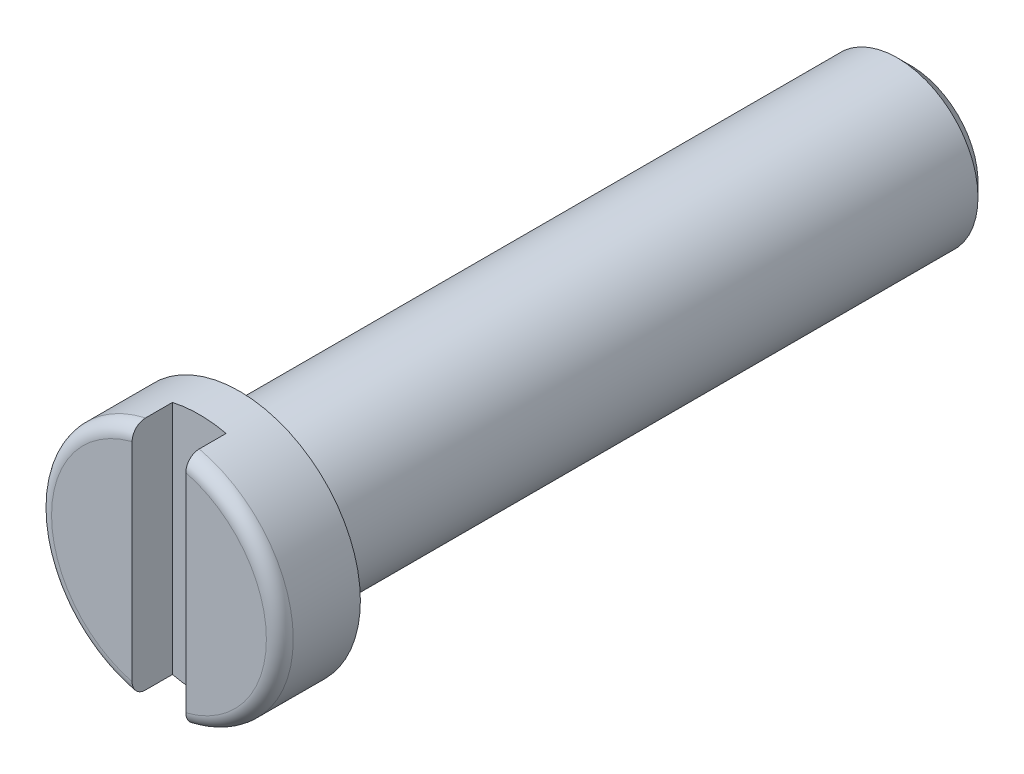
ISO-10303-21;
HEADER;
FILE_DESCRIPTION(('STEP AP214'),'2;1');
FILE_NAME('part.step','',(''),(''),'','','');
FILE_SCHEMA(('AUTOMOTIVE_DESIGN { 1 0 10303 214 1 1 1 1 }'));
ENDSEC;
DATA;
#1=APPLICATION_CONTEXT('core data for automotive mechanical design processes');
#2=APPLICATION_PROTOCOL_DEFINITION('international standard','automotive_design',2000,#1);
#3=PRODUCT_CONTEXT('',#1,'mechanical');
#4=PRODUCT('Part','Part','',(#3));
#5=PRODUCT_RELATED_PRODUCT_CATEGORY('part','',(#4));
#6=PRODUCT_DEFINITION_FORMATION('','',#4);
#7=PRODUCT_DEFINITION_CONTEXT('part definition',#1,'design');
#8=PRODUCT_DEFINITION('design','',#6,#7);
#9=PRODUCT_DEFINITION_SHAPE('','',#8);
#10=(LENGTH_UNIT() NAMED_UNIT(*) SI_UNIT(.MILLI.,.METRE.));
#11=(NAMED_UNIT(*) PLANE_ANGLE_UNIT() SI_UNIT($,.RADIAN.));
#12=(NAMED_UNIT(*) SI_UNIT($,.STERADIAN.) SOLID_ANGLE_UNIT());
#13=UNCERTAINTY_MEASURE_WITH_UNIT(LENGTH_MEASURE(1.E-05),#10,'distance_accuracy_value','');
#14=(GEOMETRIC_REPRESENTATION_CONTEXT(3) GLOBAL_UNCERTAINTY_ASSIGNED_CONTEXT((#13)) GLOBAL_UNIT_ASSIGNED_CONTEXT((#10,
#11,#12)) REPRESENTATION_CONTEXT('',''));
#15=CARTESIAN_POINT('',(0.,0.,0.));
#16=DIRECTION('',(0.,0.,1.));
#17=DIRECTION('',(1.,0.,0.));
#18=AXIS2_PLACEMENT_3D('',#15,#16,#17);
#19=CARTESIAN_POINT('',(0.,0.,3.));
#20=DIRECTION('',(0.,0.,1.));
#21=DIRECTION('',(1.,0.,0.));
#22=AXIS2_PLACEMENT_3D('',#19,#20,#21);
#23=PLANE('',#22);
#24=DIRECTION('',(0.,-1.,0.));
#25=VECTOR('',#24,1.);
#26=CARTESIAN_POINT('',(-1.,4.8446694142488,3.));
#27=LINE('',#26,#25);
#28=CARTESIAN_POINT('',(-1.,3.87298334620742,3.));
#29=VERTEX_POINT('',#28);
#30=CARTESIAN_POINT('',(-1.,-3.87298334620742,3.));
#31=VERTEX_POINT('',#30);
#32=EDGE_CURVE('E90',#29,#31,#27,.T.);
#33=ORIENTED_EDGE('',*,*,#32,.F.);
#34=CARTESIAN_POINT('',(0.,0.,3.));
#35=DIRECTION('',(0.,0.,1.));
#36=DIRECTION('',(1.,0.,0.));
#37=AXIS2_PLACEMENT_3D('',#34,#35,#36);
#38=CIRCLE('',#37,4.);
#39=EDGE_CURVE('E101',#29,#31,#38,.T.);
#40=ORIENTED_EDGE('',*,*,#39,.T.);
#41=EDGE_LOOP('',(#33,#40));
#42=FACE_BOUND('',#41,.T.);
#43=ADVANCED_FACE('F35',(#42),#23,.T.);
#44=CARTESIAN_POINT('',(0.,0.,2.5));
#45=DIRECTION('',(0.,0.,1.));
#46=DIRECTION('',(1.,0.,0.));
#47=AXIS2_PLACEMENT_3D('',#44,#45,#46);
#48=TOROIDAL_SURFACE('',#47,4.,0.5);
#49=CARTESIAN_POINT('',(-0.999999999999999,-4.32830289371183,2.73313755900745));
#50=CARTESIAN_POINT('',(-0.999999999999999,-4.34139692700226,2.70893011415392));
#51=CARTESIAN_POINT('',(-0.999999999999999,-4.35247607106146,2.68361258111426));
#52=CARTESIAN_POINT('',(-0.999999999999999,-4.37024206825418,2.63145979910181));
#53=CARTESIAN_POINT('',(-0.999999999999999,-4.3769246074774,2.60462308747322));
#54=CARTESIAN_POINT('',(-0.999999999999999,-4.38567140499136,2.55020578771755));
#55=CARTESIAN_POINT('',(-0.999999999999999,-4.38773592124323,2.52262524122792));
#56=CARTESIAN_POINT('',(-0.999999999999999,-4.38717864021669,2.46751789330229));
#57=CARTESIAN_POINT('',(-0.999999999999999,-4.38455784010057,2.43999108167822));
#58=CARTESIAN_POINT('',(-0.999999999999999,-4.37474078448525,2.3859011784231));
#59=CARTESIAN_POINT('',(-0.999999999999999,-4.3675661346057,2.35933415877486));
#60=CARTESIAN_POINT('',(-0.999999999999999,-4.34888894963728,2.30776860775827));
#61=CARTESIAN_POINT('',(-0.999999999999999,-4.33738623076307,2.282770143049));
#62=CARTESIAN_POINT('',(-0.999999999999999,-4.31031223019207,2.23484839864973));
#63=CARTESIAN_POINT('',(-0.999999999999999,-4.29471242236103,2.21194124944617));
#64=CARTESIAN_POINT('',(-0.999999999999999,-4.25995757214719,2.16900704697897));
#65=CARTESIAN_POINT('',(-1.,-4.2408022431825,2.14898022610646));
#66=CARTESIAN_POINT('',(-1.,-4.19908637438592,2.11194360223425));
#67=CARTESIAN_POINT('',(-1.,-4.17646615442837,2.09500105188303));
#68=CARTESIAN_POINT('',(-1.,-4.12876331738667,2.06503880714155));
#69=CARTESIAN_POINT('',(-1.,-4.10368039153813,2.05201960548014));
#70=CARTESIAN_POINT('',(-1.,-4.0510522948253,2.02990560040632));
#71=CARTESIAN_POINT('',(-1.,-4.0234593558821,2.02092447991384));
#72=CARTESIAN_POINT('',(-1.,-3.96717619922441,2.00759679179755));
#73=CARTESIAN_POINT('',(-1.,-3.93848582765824,2.00325087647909));
#74=CARTESIAN_POINT('',(-1.,-3.88006131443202,1.9992227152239));
#75=CARTESIAN_POINT('',(-1.,-3.85031895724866,1.99965911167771));
#76=CARTESIAN_POINT('',(-1.,-3.79131568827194,2.00545202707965));
#77=CARTESIAN_POINT('',(-1.,-3.76205482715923,2.01080906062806));
#78=CARTESIAN_POINT('',(-1.,-3.70446791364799,2.02640202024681));
#79=CARTESIAN_POINT('',(-1.,-3.67615807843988,2.03669798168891));
#80=CARTESIAN_POINT('',(-1.,-3.6216883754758,2.06193749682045));
#81=CARTESIAN_POINT('',(-1.,-3.59552850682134,2.07688104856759));
#82=CARTESIAN_POINT('',(-1.,-3.54638519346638,2.11088668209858));
#83=CARTESIAN_POINT('',(-1.,-3.52337509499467,2.12991018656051));
#84=CARTESIAN_POINT('',(-1.,-3.48100222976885,2.17166261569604));
#85=CARTESIAN_POINT('',(-1.,-3.46163884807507,2.19439091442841));
#86=CARTESIAN_POINT('',(-1.,-3.42777949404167,2.24216206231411));
#87=CARTESIAN_POINT('',(-1.,-3.41315046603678,2.26711053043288));
#88=CARTESIAN_POINT('',(-1.,-3.38848721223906,2.31918403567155));
#89=CARTESIAN_POINT('',(-1.,-3.37845177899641,2.34630849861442));
#90=CARTESIAN_POINT('',(-1.,-3.36365879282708,2.40081837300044));
#91=CARTESIAN_POINT('',(-1.,-3.35870984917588,2.42815191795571));
#92=CARTESIAN_POINT('',(-1.,-3.3535965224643,2.4832614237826));
#93=CARTESIAN_POINT('',(-1.,-3.35343132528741,2.51103730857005));
#94=CARTESIAN_POINT('',(-1.,-3.3578362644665,2.56553821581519));
#95=CARTESIAN_POINT('',(-1.,-3.36229324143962,2.59227248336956));
#96=CARTESIAN_POINT('',(-1.,-3.37560749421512,2.64461951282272));
#97=CARTESIAN_POINT('',(-1.,-3.38446478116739,2.67023227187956));
#98=CARTESIAN_POINT('',(-1.,-3.4063391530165,2.71979373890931));
#99=CARTESIAN_POINT('',(-1.,-3.419380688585,2.74373163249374));
#100=CARTESIAN_POINT('',(-1.,-3.44918161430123,2.78916638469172));
#101=CARTESIAN_POINT('',(-1.,-3.46594149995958,2.81066291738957));
#102=CARTESIAN_POINT('',(-1.,-3.50324655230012,2.85132881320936));
#103=CARTESIAN_POINT('',(-1.,-3.52389325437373,2.87040497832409));
#104=CARTESIAN_POINT('',(-1.,-3.56799383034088,2.90497477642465));
#105=CARTESIAN_POINT('',(-1.,-3.59144823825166,2.92046772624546));
#106=CARTESIAN_POINT('',(-1.,-3.64145927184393,2.94804315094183));
#107=CARTESIAN_POINT('',(-1.,-3.66810009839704,2.95997301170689));
#108=CARTESIAN_POINT('',(-1.,-3.72297295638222,2.97932213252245));
#109=CARTESIAN_POINT('',(-1.,-3.75120523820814,2.98674068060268));
#110=CARTESIAN_POINT('',(-1.,-3.80925458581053,2.99702144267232));
#111=CARTESIAN_POINT('',(-1.,-3.83909379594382,2.99975905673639));
#112=CARTESIAN_POINT('',(-1.,-3.89881097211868,3.00021047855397));
#113=CARTESIAN_POINT('',(-1.,-3.92868893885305,2.99792419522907));
#114=CARTESIAN_POINT('',(-1.,-3.9877578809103,2.98833959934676));
#115=CARTESIAN_POINT('',(-1.,-4.01694556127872,2.98102090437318));
#116=CARTESIAN_POINT('',(-1.,-4.0736528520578,2.96150482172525));
#117=CARTESIAN_POINT('',(-1.,-4.10117215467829,2.94930653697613));
#118=CARTESIAN_POINT('',(-1.,-4.15327407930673,2.92056157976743));
#119=CARTESIAN_POINT('',(-1.,-4.17789596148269,2.90408604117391));
#120=CARTESIAN_POINT('',(-1.,-4.22390116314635,2.86713988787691));
#121=CARTESIAN_POINT('',(-1.,-4.24528888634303,2.84667479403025));
#122=CARTESIAN_POINT('',(-1.,-4.27696773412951,2.81052652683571));
#123=CARTESIAN_POINT('',(-0.999999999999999,-4.28844231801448,2.79586319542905));
#124=CARTESIAN_POINT('',(-0.999999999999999,-4.30968558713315,2.76534805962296));
#125=CARTESIAN_POINT('',(-0.999999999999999,-4.31945430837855,2.74949628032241));
#126=CARTESIAN_POINT('',(-0.999999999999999,-4.32830289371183,2.73313755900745));
#127=B_SPLINE_CURVE_WITH_KNOTS('',3,(#49,#50,#51,#52,#53,#54,#55,#56,#57,#58,#59,#60,#61,#62,
#63,#64,#65,#66,#67,#68,#69,#70,#71,#72,#73,#74,#75,#76,#77,#78,#79,#80,#81,#82,#83,#84,#85,#86,
#87,#88,#89,#90,#91,#92,#93,#94,#95,#96,#97,#98,#99,#100,#101,#102,#103,#104,#105,#106,#107,
#108,#109,#110,#111,#112,#113,#114,#115,#116,#117,#118,#119,#120,#121,#122,#123,#124,#125,#126),
.UNSPECIFIED.,.T.,.F.,(4,2,2,2,2,2,2,2,2,2,2,2,2,2,2,2,2,2,2,2,2,2,2,2,2,2,2,2,2,2,2,2,2,2,2,2,
2,2,4),(0.,0.0824988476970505,0.165078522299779,0.247653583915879,0.330211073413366,
0.41237976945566,0.494551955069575,0.577312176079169,0.660079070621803,0.744477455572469,
0.828886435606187,0.915542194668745,1.00221014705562,1.09103297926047,1.17986510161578,
1.26980549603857,1.35974585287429,1.44887059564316,1.53798029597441,1.62430876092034,
1.71061452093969,1.79353865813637,1.87644868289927,1.95737576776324,2.03830305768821,
2.11971213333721,2.20113206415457,2.28508485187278,2.36905363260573,2.45622501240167,
2.54341014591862,2.63288184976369,2.72235517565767,2.81219304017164,2.90204742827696,
2.99049381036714,3.07881865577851,3.13457027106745,3.1903207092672),.UNSPECIFIED.);
#128=CARTESIAN_POINT('',(-0.999999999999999,-4.38748219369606,2.5));
#129=VERTEX_POINT('',#128);
#130=EDGE_CURVE('E59',#31,#129,#127,.T.);
#131=ORIENTED_EDGE('',*,*,#130,.F.);
#132=ORIENTED_EDGE('',*,*,#39,.F.);
#133=CARTESIAN_POINT('',(-1.,3.39057443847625,2.6836974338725));
#134=CARTESIAN_POINT('',(-1.,3.38026979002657,2.65867363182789));
#135=CARTESIAN_POINT('',(-1.,3.37204228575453,2.63277673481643));
#136=CARTESIAN_POINT('',(-1.,3.36004261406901,2.57995244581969));
#137=CARTESIAN_POINT('',(-1.,3.35627419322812,2.55302420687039));
#138=CARTESIAN_POINT('',(-1.,3.35333822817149,2.49891568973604));
#139=CARTESIAN_POINT('',(-1.,3.35417065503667,2.47173541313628));
#140=CARTESIAN_POINT('',(-1.,3.36040633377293,2.41791079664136));
#141=CARTESIAN_POINT('',(-1.,3.3658088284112,2.39126636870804));
#142=CARTESIAN_POINT('',(-1.,3.38096424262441,2.33933942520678));
#143=CARTESIAN_POINT('',(-1.,3.39070342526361,2.31405288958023));
#144=CARTESIAN_POINT('',(-1.,3.41419683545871,2.26542149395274));
#145=CARTESIAN_POINT('',(-1.,3.42795151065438,2.24207685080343));
#146=CARTESIAN_POINT('',(-1.,3.45939431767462,2.19740597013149));
#147=CARTESIAN_POINT('',(-1.,3.47716497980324,2.17613788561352));
#148=CARTESIAN_POINT('',(-1.,3.51590595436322,2.13675097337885));
#149=CARTESIAN_POINT('',(-1.,3.53687683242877,2.11863270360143));
#150=CARTESIAN_POINT('',(-1.,3.5822709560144,2.08533440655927));
#151=CARTESIAN_POINT('',(-1.,3.60679482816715,2.07029154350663));
#152=CARTESIAN_POINT('',(-1.,3.65795801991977,2.04438352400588));
#153=CARTESIAN_POINT('',(-1.,3.6845977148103,2.03351911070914));
#154=CARTESIAN_POINT('',(-1.,3.74017639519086,2.01593129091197));
#155=CARTESIAN_POINT('',(-1.,3.76916213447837,2.00935537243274));
#156=CARTESIAN_POINT('',(-1.,3.82782363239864,2.00109050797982));
#157=CARTESIAN_POINT('',(-1.,3.85749946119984,1.99940206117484));
#158=CARTESIAN_POINT('',(-1.,3.91711850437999,2.00098282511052));
#159=CARTESIAN_POINT('',(-1.,3.94705999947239,2.00431852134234));
#160=CARTESIAN_POINT('',(-1.,4.00594728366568,2.01601429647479));
#161=CARTESIAN_POINT('',(-1.,4.0348930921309,2.02437427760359));
#162=CARTESIAN_POINT('',(-1.,4.0906765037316,2.04583436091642));
#163=CARTESIAN_POINT('',(-1.,4.11753063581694,2.05889143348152));
#164=CARTESIAN_POINT('',(-1.,4.1685913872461,2.08943513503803));
#165=CARTESIAN_POINT('',(-1.,4.19279832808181,2.10692122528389));
#166=CARTESIAN_POINT('',(-1.,4.23724813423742,2.14538622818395));
#167=CARTESIAN_POINT('',(-1.,4.25757209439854,2.16627139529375));
#168=CARTESIAN_POINT('',(-1.,4.29430425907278,2.21124139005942));
#169=CARTESIAN_POINT('',(-1.,4.31071309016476,2.23532570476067));
#170=CARTESIAN_POINT('',(-1.,4.33867606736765,2.28529560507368));
#171=CARTESIAN_POINT('',(-1.,4.35035127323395,2.31111346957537));
#172=CARTESIAN_POINT('',(-1.,4.36909650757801,2.36437002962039));
#173=CARTESIAN_POINT('',(-1.,4.37616714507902,2.3918085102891));
#174=CARTESIAN_POINT('',(-1.,4.38537028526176,2.44691397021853));
#175=CARTESIAN_POINT('',(-1.,4.38760230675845,2.47456436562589));
#176=CARTESIAN_POINT('',(-1.,4.38735211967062,2.52984287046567));
#177=CARTESIAN_POINT('',(-1.,4.38487021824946,2.5574709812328));
#178=CARTESIAN_POINT('',(-1.,4.37531136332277,2.61169602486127));
#179=CARTESIAN_POINT('',(-1.,4.36827043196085,2.63829932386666));
#180=CARTESIAN_POINT('',(-1.,4.34985203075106,2.68995820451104));
#181=CARTESIAN_POINT('',(-1.,4.33847450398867,2.71501376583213));
#182=CARTESIAN_POINT('',(-1.,4.31164215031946,2.76306441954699));
#183=CARTESIAN_POINT('',(-1.,4.29615952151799,2.7860439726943));
#184=CARTESIAN_POINT('',(-1.,4.26162497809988,2.82914076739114));
#185=CARTESIAN_POINT('',(-1.,4.24257277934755,2.84925778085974));
#186=CARTESIAN_POINT('',(-1.,4.20105169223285,2.88648866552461));
#187=CARTESIAN_POINT('',(-1.,4.17852327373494,2.90353611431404));
#188=CARTESIAN_POINT('',(-1.,4.13098548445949,2.93372158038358));
#189=CARTESIAN_POINT('',(-1.,4.10597579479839,2.94685909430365));
#190=CARTESIAN_POINT('',(-1.,4.05347705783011,2.96922263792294));
#191=CARTESIAN_POINT('',(-1.,4.02593979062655,2.97833546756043));
#192=CARTESIAN_POINT('',(-1.,3.9697457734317,2.99193437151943));
#193=CARTESIAN_POINT('',(-1.,3.94108886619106,2.99641979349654));
#194=CARTESIAN_POINT('',(-1.,3.8827052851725,3.00073536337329));
#195=CARTESIAN_POINT('',(-1.,3.85296977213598,3.00044640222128));
#196=CARTESIAN_POINT('',(-1.,3.79395653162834,2.99494874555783));
#197=CARTESIAN_POINT('',(-1.,3.76467883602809,2.98973970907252));
#198=CARTESIAN_POINT('',(-1.,3.70702842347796,2.97444095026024));
#199=CARTESIAN_POINT('',(-1.,3.67867181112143,2.96429040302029));
#200=CARTESIAN_POINT('',(-1.,3.62407616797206,2.9393301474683));
#201=CARTESIAN_POINT('',(-1.,3.5978376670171,2.92451927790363));
#202=CARTESIAN_POINT('',(-1.,3.54849522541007,2.89075244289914));
#203=CARTESIAN_POINT('',(-1.,3.5253672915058,2.87183155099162));
#204=CARTESIAN_POINT('',(-1.,3.48276511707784,2.83027666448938));
#205=CARTESIAN_POINT('',(-1.,3.46328580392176,2.80764790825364));
#206=CARTESIAN_POINT('',(-1.,3.43486077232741,2.76799179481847));
#207=CARTESIAN_POINT('',(-1.,3.42464153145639,2.75186230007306));
#208=CARTESIAN_POINT('',(-1.,3.40612921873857,2.7185321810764));
#209=CARTESIAN_POINT('',(-1.,3.39783607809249,2.70133159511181));
#210=CARTESIAN_POINT('',(-1.,3.39057443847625,2.6836974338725));
#211=B_SPLINE_CURVE_WITH_KNOTS('',3,(#133,#134,#135,#136,#137,#138,#139,#140,#141,#142,#143,
#144,#145,#146,#147,#148,#149,#150,#151,#152,#153,#154,#155,#156,#157,#158,#159,#160,#161,#162,
#163,#164,#165,#166,#167,#168,#169,#170,#171,#172,#173,#174,#175,#176,#177,#178,#179,#180,#181,
#182,#183,#184,#185,#186,#187,#188,#189,#190,#191,#192,#193,#194,#195,#196,#197,#198,#199,#200,
#201,#202,#203,#204,#205,#206,#207,#208,#209,#210),.UNSPECIFIED.,.T.,.F.,(4,2,2,2,2,2,2,2,2,2,2,
2,2,2,2,2,2,2,2,2,2,2,2,2,2,2,2,2,2,2,2,2,2,2,2,2,2,2,4),(0.,0.0811193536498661,
0.162306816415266,0.243493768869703,0.324667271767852,0.405585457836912,0.486512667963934,
0.569284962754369,0.6520719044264,0.737992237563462,0.823927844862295,0.912681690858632,
1.00144460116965,1.09139249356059,1.18133863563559,1.27048093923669,1.35961240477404,
1.44660788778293,1.53358943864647,1.61817976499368,1.70275890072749,1.78558125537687,
1.86839821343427,1.95056866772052,2.03274020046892,2.11548312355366,2.19823263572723,
2.28260038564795,2.36697899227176,2.45359948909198,2.54023219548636,2.62902936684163,
2.71783269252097,2.80775784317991,2.89770541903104,2.98691362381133,3.07599686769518,
3.1331633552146,3.19032780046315),.UNSPECIFIED.);
#212=CARTESIAN_POINT('',(-1.,4.38748219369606,2.5));
#213=VERTEX_POINT('',#212);
#214=EDGE_CURVE('E86',#213,#29,#211,.T.);
#215=ORIENTED_EDGE('',*,*,#214,.F.);
#216=CARTESIAN_POINT('',(0.,0.,2.5));
#217=DIRECTION('',(0.,0.,1.));
#218=DIRECTION('',(1.,0.,0.));
#219=AXIS2_PLACEMENT_3D('',#216,#217,#218);
#220=CIRCLE('',#219,4.5);
#221=EDGE_CURVE('E108',#129,#213,#220,.F.);
#222=ORIENTED_EDGE('',*,*,#221,.F.);
#223=EDGE_LOOP('',(#131,#132,#215,#222));
#224=FACE_BOUND('',#223,.T.);
#225=ADVANCED_FACE('F103',(#224),#48,.T.);
#226=CARTESIAN_POINT('',(0.,0.,0.));
#227=DIRECTION('',(0.,0.,1.));
#228=DIRECTION('',(1.,0.,0.));
#229=AXIS2_PLACEMENT_3D('',#226,#227,#228);
#230=PLANE('',#229);
#231=CARTESIAN_POINT('',(0.,0.,0.));
#232=DIRECTION('',(0.,0.,1.));
#233=DIRECTION('',(1.,0.,0.));
#234=AXIS2_PLACEMENT_3D('',#231,#232,#233);
#235=CIRCLE('',#234,4.5);
#236=CARTESIAN_POINT('',(4.5,0.,0.));
#237=VERTEX_POINT('',#236);
#238=EDGE_CURVE('E168',#237,#237,#235,.T.);
#239=ORIENTED_EDGE('',*,*,#238,.F.);
#240=EDGE_LOOP('',(#239));
#241=FACE_BOUND('',#240,.T.);
#242=CARTESIAN_POINT('',(0.,0.,0.));
#243=DIRECTION('',(0.,0.,1.));
#244=DIRECTION('',(1.,0.,0.));
#245=AXIS2_PLACEMENT_3D('',#242,#243,#244);
#246=CIRCLE('',#245,3.);
#247=CARTESIAN_POINT('',(3.,0.,0.));
#248=VERTEX_POINT('',#247);
#249=EDGE_CURVE('E173',#248,#248,#246,.F.);
#250=ORIENTED_EDGE('',*,*,#249,.F.);
#251=EDGE_LOOP('',(#250));
#252=FACE_BOUND('',#251,.T.);
#253=ADVANCED_FACE('F196',(#241,#252),#230,.F.);
#254=CARTESIAN_POINT('',(0.,0.,3.));
#255=DIRECTION('',(0.,0.,-1.));
#256=DIRECTION('',(-1.,0.,0.));
#257=AXIS2_PLACEMENT_3D('',#254,#255,#256);
#258=CYLINDRICAL_SURFACE('',#257,4.5);
#259=ORIENTED_EDGE('',*,*,#221,.T.);
#260=DIRECTION('',(0.,0.,-1.));
#261=VECTOR('',#260,1.);
#262=CARTESIAN_POINT('',(-1.,4.38748219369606,3.));
#263=LINE('',#262,#261);
#264=CARTESIAN_POINT('',(-1.,4.38748219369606,1.5));
#265=VERTEX_POINT('',#264);
#266=EDGE_CURVE('E92',#213,#265,#263,.T.);
#267=ORIENTED_EDGE('',*,*,#266,.T.);
#268=CARTESIAN_POINT('',(0.,0.,1.5));
#269=DIRECTION('',(0.,0.,1.));
#270=DIRECTION('',(1.,0.,0.));
#271=AXIS2_PLACEMENT_3D('',#268,#269,#270);
#272=CIRCLE('',#271,4.5);
#273=CARTESIAN_POINT('',(0.999999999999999,4.38748219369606,1.5));
#274=VERTEX_POINT('',#273);
#275=EDGE_CURVE('E11',#274,#265,#272,.T.);
#276=ORIENTED_EDGE('',*,*,#275,.F.);
#277=DIRECTION('',(0.,0.,-1.));
#278=VECTOR('',#277,1.);
#279=CARTESIAN_POINT('',(0.999999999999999,4.38748219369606,3.));
#280=LINE('',#279,#278);
#281=CARTESIAN_POINT('',(0.999999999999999,4.38748219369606,2.5));
#282=VERTEX_POINT('',#281);
#283=EDGE_CURVE('E152',#274,#282,#280,.F.);
#284=ORIENTED_EDGE('',*,*,#283,.T.);
#285=CARTESIAN_POINT('',(1.,-4.38748219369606,2.5));
#286=VERTEX_POINT('',#285);
#287=EDGE_CURVE('E104',#282,#286,#220,.F.);
#288=ORIENTED_EDGE('',*,*,#287,.T.);
#289=DIRECTION('',(0.,0.,-1.));
#290=VECTOR('',#289,1.);
#291=CARTESIAN_POINT('',(1.,-4.38748219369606,3.));
#292=LINE('',#291,#290);
#293=CARTESIAN_POINT('',(1.,-4.38748219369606,1.5));
#294=VERTEX_POINT('',#293);
#295=EDGE_CURVE('E149',#286,#294,#292,.T.);
#296=ORIENTED_EDGE('',*,*,#295,.T.);
#297=CARTESIAN_POINT('',(-0.999999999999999,-4.38748219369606,1.5));
#298=VERTEX_POINT('',#297);
#299=EDGE_CURVE('E40',#298,#294,#272,.T.);
#300=ORIENTED_EDGE('',*,*,#299,.F.);
#301=DIRECTION('',(0.,0.,-1.));
#302=VECTOR('',#301,1.);
#303=CARTESIAN_POINT('',(-0.999999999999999,-4.38748219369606,3.));
#304=LINE('',#303,#302);
#305=EDGE_CURVE('E158',#298,#129,#304,.F.);
#306=ORIENTED_EDGE('',*,*,#305,.T.);
#307=EDGE_LOOP('',(#259,#267,#276,#284,#288,#296,#300,#306));
#308=FACE_BOUND('',#307,.T.);
#309=ORIENTED_EDGE('',*,*,#238,.T.);
#310=EDGE_LOOP('',(#309));
#311=FACE_BOUND('',#310,.T.);
#312=ADVANCED_FACE('F154',(#308,#311),#258,.T.);
#313=DIRECTION('',(0.,1.,0.));
#314=VECTOR('',#313,1.);
#315=CARTESIAN_POINT('',(0.999999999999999,4.8446694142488,3.));
#316=LINE('',#315,#314);
#317=CARTESIAN_POINT('',(1.,-3.87298334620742,3.));
#318=VERTEX_POINT('',#317);
#319=CARTESIAN_POINT('',(0.999999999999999,3.87298334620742,3.));
#320=VERTEX_POINT('',#319);
#321=EDGE_CURVE('E51',#318,#320,#316,.T.);
#322=ORIENTED_EDGE('',*,*,#321,.F.);
#323=EDGE_CURVE('E105',#318,#320,#38,.T.);
#324=ORIENTED_EDGE('',*,*,#323,.T.);
#325=EDGE_LOOP('',(#322,#324));
#326=FACE_BOUND('',#325,.T.);
#327=ADVANCED_FACE('F200',(#326),#23,.T.);
#328=CARTESIAN_POINT('',(0.,0.,-25.));
#329=DIRECTION('',(0.,0.,-1.));
#330=DIRECTION('',(-1.,0.,0.));
#331=AXIS2_PLACEMENT_3D('',#328,#329,#330);
#332=PLANE('',#331);
#333=CARTESIAN_POINT('',(0.,0.,-25.));
#334=DIRECTION('',(0.,0.,-1.));
#335=DIRECTION('',(-1.,0.,0.));
#336=AXIS2_PLACEMENT_3D('',#333,#334,#335);
#337=CIRCLE('',#336,2.5);
#338=CARTESIAN_POINT('',(-2.5,0.,-25.));
#339=VERTEX_POINT('',#338);
#340=EDGE_CURVE('E175',#339,#339,#337,.T.);
#341=ORIENTED_EDGE('',*,*,#340,.T.);
#342=EDGE_LOOP('',(#341));
#343=FACE_BOUND('',#342,.T.);
#344=CARTESIAN_POINT('',(0.,0.,-25.));
#345=DIRECTION('',(0.,0.,-1.));
#346=DIRECTION('',(-1.,0.,0.));
#347=AXIS2_PLACEMENT_3D('',#344,#345,#346);
#348=CIRCLE('',#347,2.);
#349=CARTESIAN_POINT('',(-2.,0.,-25.));
#350=VERTEX_POINT('',#349);
#351=EDGE_CURVE('E165',#350,#350,#348,.T.);
#352=ORIENTED_EDGE('',*,*,#351,.F.);
#353=EDGE_LOOP('',(#352));
#354=FACE_BOUND('',#353,.T.);
#355=ADVANCED_FACE('F206',(#343,#354),#332,.T.);
#356=CARTESIAN_POINT('',(0.,0.,-25.));
#357=DIRECTION('',(0.,0.,1.));
#358=DIRECTION('',(1.,0.,0.));
#359=AXIS2_PLACEMENT_3D('',#356,#357,#358);
#360=CYLINDRICAL_SURFACE('',#359,3.);
#361=CARTESIAN_POINT('',(0.,0.,-24.5));
#362=DIRECTION('',(0.,0.,-1.));
#363=DIRECTION('',(-1.,0.,0.));
#364=AXIS2_PLACEMENT_3D('',#361,#362,#363);
#365=CIRCLE('',#364,3.);
#366=CARTESIAN_POINT('',(-3.,0.,-24.5));
#367=VERTEX_POINT('',#366);
#368=EDGE_CURVE('E111',#367,#367,#365,.F.);
#369=ORIENTED_EDGE('',*,*,#368,.T.);
#370=EDGE_LOOP('',(#369));
#371=FACE_BOUND('',#370,.T.);
#372=ORIENTED_EDGE('',*,*,#249,.T.);
#373=EDGE_LOOP('',(#372));
#374=FACE_BOUND('',#373,.T.);
#375=ADVANCED_FACE('F182',(#371,#374),#360,.T.);
#376=CARTESIAN_POINT('',(0.,0.,-25.));
#377=DIRECTION('',(0.,0.,1.));
#378=DIRECTION('',(1.,0.,0.));
#379=AXIS2_PLACEMENT_3D('',#376,#377,#378);
#380=CYLINDRICAL_SURFACE('',#379,2.);
#381=ORIENTED_EDGE('',*,*,#351,.T.);
#382=EDGE_LOOP('',(#381));
#383=FACE_BOUND('',#382,.T.);
#384=CARTESIAN_POINT('',(0.,0.,0.));
#385=DIRECTION('',(0.,0.,-1.));
#386=DIRECTION('',(-1.,0.,0.));
#387=AXIS2_PLACEMENT_3D('',#384,#385,#386);
#388=CIRCLE('',#387,2.);
#389=CARTESIAN_POINT('',(-2.,0.,0.));
#390=VERTEX_POINT('',#389);
#391=EDGE_CURVE('E164',#390,#390,#388,.T.);
#392=ORIENTED_EDGE('',*,*,#391,.F.);
#393=EDGE_LOOP('',(#392));
#394=FACE_BOUND('',#393,.T.);
#395=ADVANCED_FACE('F132',(#383,#394),#380,.F.);
#396=ORIENTED_EDGE('',*,*,#391,.T.);
#397=EDGE_LOOP('',(#396));
#398=FACE_BOUND('',#397,.T.);
#399=ADVANCED_FACE('F188',(#398),#230,.F.);
#400=CARTESIAN_POINT('',(0.,0.,-25.));
#401=DIRECTION('',(0.,0.,1.));
#402=DIRECTION('',(1.,0.,0.));
#403=AXIS2_PLACEMENT_3D('',#400,#401,#402);
#404=CONICAL_SURFACE('',#403,2.5,0.785398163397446);
#405=ORIENTED_EDGE('',*,*,#368,.F.);
#406=EDGE_LOOP('',(#405));
#407=FACE_BOUND('',#406,.T.);
#408=ORIENTED_EDGE('',*,*,#340,.F.);
#409=EDGE_LOOP('',(#408));
#410=FACE_BOUND('',#409,.T.);
#411=ADVANCED_FACE('F185',(#407,#410),#404,.T.);
#412=CARTESIAN_POINT('',(1.,-4.32830289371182,2.73313755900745));
#413=CARTESIAN_POINT('',(1.,-4.31482198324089,2.75805470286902));
#414=CARTESIAN_POINT('',(1.,-4.29918542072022,2.78183265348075));
#415=CARTESIAN_POINT('',(1.,-4.26410188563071,2.82642259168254));
#416=CARTESIAN_POINT('',(1.,-4.24464933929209,2.84723016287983));
#417=CARTESIAN_POINT('',(1.,-4.20257677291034,2.8852745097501));
#418=CARTESIAN_POINT('',(1.,-4.17996183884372,2.9025169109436));
#419=CARTESIAN_POINT('',(1.,-4.13221425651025,2.93304137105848));
#420=CARTESIAN_POINT('',(1.,-4.10708222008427,2.94632438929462));
#421=CARTESIAN_POINT('',(1.,-4.05447621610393,2.96885932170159));
#422=CARTESIAN_POINT('',(1.,-4.02696548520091,2.97802537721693));
#423=CARTESIAN_POINT('',(1.,-3.97081426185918,2.99173543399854));
#424=CARTESIAN_POINT('',(1.,-3.9421735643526,2.99627859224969));
#425=CARTESIAN_POINT('',(1.,-3.88381029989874,3.00071392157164));
#426=CARTESIAN_POINT('',(1.,-3.85407861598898,3.00048657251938));
#427=CARTESIAN_POINT('',(1.,-3.79506164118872,2.99511251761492));
#428=CARTESIAN_POINT('',(1.,-3.76577639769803,2.98996529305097));
#429=CARTESIAN_POINT('',(1.,-3.70809397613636,2.97478777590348));
#430=CARTESIAN_POINT('',(1.,-3.67971304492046,2.96469558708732));
#431=CARTESIAN_POINT('',(1.,-3.62506638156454,2.93985111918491));
#432=CARTESIAN_POINT('',(1.,-3.59880064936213,2.92509884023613));
#433=CARTESIAN_POINT('',(1.,-3.54940022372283,2.8914476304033));
#434=CARTESIAN_POINT('',(1.,-3.52624065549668,2.87258527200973));
#435=CARTESIAN_POINT('',(1.,-3.48354141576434,2.83112816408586));
#436=CARTESIAN_POINT('',(1.,-3.46400115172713,2.80853402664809));
#437=CARTESIAN_POINT('',(1.,-3.42976429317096,2.76098614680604));
#438=CARTESIAN_POINT('',(1.,-3.41493692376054,2.7361266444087));
#439=CARTESIAN_POINT('',(1.,-3.38986474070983,2.6841948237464));
#440=CARTESIAN_POINT('',(1.,-3.37961872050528,2.6571230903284));
#441=CARTESIAN_POINT('',(1.,-3.36440898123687,2.60268059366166));
#442=CARTESIAN_POINT('',(1.,-3.35925371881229,2.5753632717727));
#443=CARTESIAN_POINT('',(1.,-3.35373083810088,2.5202503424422));
#444=CARTESIAN_POINT('',(1.,-3.35336239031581,2.49245481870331));
#445=CARTESIAN_POINT('',(1.,-3.3573753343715,2.4378963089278));
#446=CARTESIAN_POINT('',(1.,-3.36164079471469,2.41112469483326));
#447=CARTESIAN_POINT('',(1.,-3.37458394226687,2.35867254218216));
#448=CARTESIAN_POINT('',(1.,-3.38326162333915,2.33299200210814));
#449=CARTESIAN_POINT('',(1.,-3.4047859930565,2.28328400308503));
#450=CARTESIAN_POINT('',(1.,-3.41765453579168,2.25926602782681));
#451=CARTESIAN_POINT('',(1.,-3.4471262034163,2.21364510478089));
#452=CARTESIAN_POINT('',(1.,-3.46372982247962,2.19204247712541));
#453=CARTESIAN_POINT('',(1.,-3.50073112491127,2.15114594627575));
#454=CARTESIAN_POINT('',(1.,-3.52122974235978,2.131943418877));
#455=CARTESIAN_POINT('',(1.,-3.56505627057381,2.09709849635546));
#456=CARTESIAN_POINT('',(1.,-3.58838471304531,2.0814567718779));
#457=CARTESIAN_POINT('',(1.,-3.63816589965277,2.05355775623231));
#458=CARTESIAN_POINT('',(1.,-3.66470396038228,2.04145260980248));
#459=CARTESIAN_POINT('',(1.,-3.71940072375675,2.0217366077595));
#460=CARTESIAN_POINT('',(1.,-3.74755968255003,2.0141264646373));
#461=CARTESIAN_POINT('',(1.,-3.80550359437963,2.00344281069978));
#462=CARTESIAN_POINT('',(1.,-3.8353118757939,2.00049540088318));
#463=CARTESIAN_POINT('',(1.,-3.8950038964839,1.99961941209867));
#464=CARTESIAN_POINT('',(1.,-3.92488763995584,2.0016911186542));
#465=CARTESIAN_POINT('',(1.,-3.98402275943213,2.01084917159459));
#466=CARTESIAN_POINT('',(1.,-4.01327053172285,2.0179588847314));
#467=CARTESIAN_POINT('',(1.,-4.07012584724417,2.03706598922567));
#468=CARTESIAN_POINT('',(1.,-4.09773349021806,2.04906308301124));
#469=CARTESIAN_POINT('',(1.,-4.1500436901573,2.07742511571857));
#470=CARTESIAN_POINT('',(1.,-4.17478526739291,2.09371801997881));
#471=CARTESIAN_POINT('',(1.,-4.22108435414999,2.13033265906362));
#472=CARTESIAN_POINT('',(1.,-4.24264231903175,2.1506538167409));
#473=CARTESIAN_POINT('',(1.,-4.28134491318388,2.19416929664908));
#474=CARTESIAN_POINT('',(1.,-4.29859183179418,2.2172726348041));
#475=CARTESIAN_POINT('',(1.,-4.32883870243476,2.26610896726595));
#476=CARTESIAN_POINT('',(1.,-4.34183949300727,2.29184144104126));
#477=CARTESIAN_POINT('',(1.,-4.36287998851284,2.34448086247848));
#478=CARTESIAN_POINT('',(1.,-4.37104028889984,2.37133964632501));
#479=CARTESIAN_POINT('',(1.,-4.3826533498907,2.42606407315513));
#480=CARTESIAN_POINT('',(1.,-4.38610538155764,2.4539298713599));
#481=CARTESIAN_POINT('',(1.,-4.38816896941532,2.50939191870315));
#482=CARTESIAN_POINT('',(1.,-4.38685657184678,2.53698541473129));
#483=CARTESIAN_POINT('',(1.,-4.37960226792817,2.59153146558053));
#484=CARTESIAN_POINT('',(1.,-4.37366643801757,2.6184848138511));
#485=CARTESIAN_POINT('',(1.,-4.36078005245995,2.6600290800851));
#486=CARTESIAN_POINT('',(1.,-4.35528532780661,2.67508736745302));
#487=CARTESIAN_POINT('',(1.,-4.34285771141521,2.70459766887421));
#488=CARTESIAN_POINT('',(1.,-4.33592484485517,2.71904969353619));
#489=CARTESIAN_POINT('',(1.,-4.32830289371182,2.73313755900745));
#490=B_SPLINE_CURVE_WITH_KNOTS('',3,(#412,#413,#414,#415,#416,#417,#418,#419,#420,#421,#422,
#423,#424,#425,#426,#427,#428,#429,#430,#431,#432,#433,#434,#435,#436,#437,#438,#439,#440,#441,
#442,#443,#444,#445,#446,#447,#448,#449,#450,#451,#452,#453,#454,#455,#456,#457,#458,#459,#460,
#461,#462,#463,#464,#465,#466,#467,#468,#469,#470,#471,#472,#473,#474,#475,#476,#477,#478,#479,
#480,#481,#482,#483,#484,#485,#486,#487,#488,#489),.UNSPECIFIED.,.T.,.F.,(4,2,2,2,2,2,2,2,2,2,2,
2,2,2,2,2,2,2,2,2,2,2,2,2,2,2,2,2,2,2,2,2,2,2,2,2,2,2,4),(0.,0.0849302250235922,
0.169985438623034,0.254905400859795,0.339804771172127,0.426400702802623,0.513012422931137,
0.601796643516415,0.690590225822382,0.78052478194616,0.870459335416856,0.959624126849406,
1.04877430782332,1.13517556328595,1.22155405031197,1.30454222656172,1.38751602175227,
1.46846078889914,1.54940544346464,1.63077914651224,1.71216362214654,1.79604968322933,
1.87995153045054,1.96705905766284,2.05418038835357,2.14361988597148,2.23306447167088,
2.32292664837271,2.41278335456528,2.50121979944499,2.58964358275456,2.67571128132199,
2.76176197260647,2.84556739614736,2.92938579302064,3.01187226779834,3.09425051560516,
3.14226992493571,3.19028849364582),.UNSPECIFIED.);
#491=EDGE_CURVE('E97',#286,#318,#490,.T.);
#492=ORIENTED_EDGE('',*,*,#491,.F.);
#493=ORIENTED_EDGE('',*,*,#287,.F.);
#494=CARTESIAN_POINT('',(0.999999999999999,3.39057443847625,2.6836974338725));
#495=CARTESIAN_POINT('',(0.999999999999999,3.40133734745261,2.70982698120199));
#496=CARTESIAN_POINT('',(0.999999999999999,3.41438218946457,2.73504364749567));
#497=CARTESIAN_POINT('',(0.999999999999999,3.4445741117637,2.78292115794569));
#498=CARTESIAN_POINT('',(0.999999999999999,3.46172782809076,2.80557777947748));
#499=CARTESIAN_POINT('',(0.999999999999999,3.49952399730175,2.84767535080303));
#500=CARTESIAN_POINT('',(0.999999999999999,3.52015895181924,2.86712303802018));
#501=CARTESIAN_POINT('',(0.999999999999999,3.56431158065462,2.90238834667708));
#502=CARTESIAN_POINT('',(0.999999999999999,3.58782855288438,2.91820684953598));
#503=CARTESIAN_POINT('',(0.999999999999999,3.63780150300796,2.94626306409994));
#504=CARTESIAN_POINT('',(0.999999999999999,3.6643223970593,2.95838515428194));
#505=CARTESIAN_POINT('',(0.999999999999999,3.71898899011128,2.97813933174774));
#506=CARTESIAN_POINT('',(0.999999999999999,3.74713501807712,2.98577050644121));
#507=CARTESIAN_POINT('',(0.999999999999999,3.80506205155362,2.99650078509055));
#508=CARTESIAN_POINT('',(0.999999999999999,3.83486666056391,2.99947288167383));
#509=CARTESIAN_POINT('',(0.999999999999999,3.89455558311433,3.00039882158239));
#510=CARTESIAN_POINT('',(0.999999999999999,3.92443990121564,2.99835237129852));
#511=CARTESIAN_POINT('',(0.999999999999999,3.98358222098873,2.98924463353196));
#512=CARTESIAN_POINT('',(0.999999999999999,4.01283659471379,2.98215968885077));
#513=CARTESIAN_POINT('',(0.999999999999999,4.06970917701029,2.96310088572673));
#514=CARTESIAN_POINT('',(0.999999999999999,4.09732749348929,2.95112735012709));
#515=CARTESIAN_POINT('',(0.999999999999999,4.14966407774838,2.92280949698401));
#516=CARTESIAN_POINT('',(0.999999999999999,4.17442119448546,2.90653704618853));
#517=CARTESIAN_POINT('',(0.999999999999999,4.22075471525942,2.86996037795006));
#518=CARTESIAN_POINT('',(0.999999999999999,4.24233157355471,2.84965673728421));
#519=CARTESIAN_POINT('',(0.999999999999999,4.2810740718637,2.80617246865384));
#520=CARTESIAN_POINT('',(0.999999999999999,4.29834195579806,2.78308294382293));
#521=CARTESIAN_POINT('',(0.999999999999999,4.32863349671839,2.73426948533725));
#522=CARTESIAN_POINT('',(0.999999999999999,4.34165781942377,2.70854596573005));
#523=CARTESIAN_POINT('',(0.999999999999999,4.36274661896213,2.65591721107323));
#524=CARTESIAN_POINT('',(0.999999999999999,4.37093123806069,2.62906008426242));
#525=CARTESIAN_POINT('',(0.999999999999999,4.38259088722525,2.57434271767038));
#526=CARTESIAN_POINT('',(0.999999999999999,4.38606643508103,2.54648258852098));
#527=CARTESIAN_POINT('',(0.999999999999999,4.3881757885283,2.49103968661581));
#528=CARTESIAN_POINT('',(0.999999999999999,4.38688815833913,2.46345987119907));
#529=CARTESIAN_POINT('',(0.999999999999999,4.37968837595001,2.40891183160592));
#530=CARTESIAN_POINT('',(0.999999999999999,4.37377639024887,2.38194358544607));
#531=CARTESIAN_POINT('',(0.999999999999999,4.35753637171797,2.32944092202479));
#532=CARTESIAN_POINT('',(0.999999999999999,4.34721845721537,2.303903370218));
#533=CARTESIAN_POINT('',(0.999999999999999,4.32249111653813,2.25489442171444));
#534=CARTESIAN_POINT('',(0.999999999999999,4.30808152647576,2.23142310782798));
#535=CARTESIAN_POINT('',(0.999999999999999,4.27541035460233,2.18689688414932));
#536=CARTESIAN_POINT('',(0.999999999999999,4.25710427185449,2.16587465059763));
#537=CARTESIAN_POINT('',(0.999999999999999,4.2172941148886,2.12711732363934));
#538=CARTESIAN_POINT('',(0.999999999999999,4.19578971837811,2.10938256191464));
#539=CARTESIAN_POINT('',(0.999999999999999,4.14967111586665,2.07726135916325));
#540=CARTESIAN_POINT('',(0.999999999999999,4.12499676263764,2.06296130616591));
#541=CARTESIAN_POINT('',(0.999999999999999,4.07364563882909,2.03858105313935));
#542=CARTESIAN_POINT('',(0.999999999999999,4.04696859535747,2.02850142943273));
#543=CARTESIAN_POINT('',(0.999999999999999,3.99159648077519,2.01256453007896));
#544=CARTESIAN_POINT('',(0.999999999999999,3.96286629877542,2.00682920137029));
#545=CARTESIAN_POINT('',(0.999999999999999,3.90485390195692,2.00015059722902));
#546=CARTESIAN_POINT('',(0.999999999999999,3.87557161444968,1.99920795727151));
#547=CARTESIAN_POINT('',(0.999999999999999,3.81661176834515,2.00214811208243));
#548=CARTESIAN_POINT('',(0.999999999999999,3.78693940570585,2.00613597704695));
#549=CARTESIAN_POINT('',(0.999999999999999,3.72867325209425,2.01900581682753));
#550=CARTESIAN_POINT('',(0.999999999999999,3.70007954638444,2.02788817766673));
#551=CARTESIAN_POINT('',(0.999999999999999,3.64463235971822,2.05039026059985));
#552=CARTESIAN_POINT('',(0.999999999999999,3.61778941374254,2.06403599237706));
#553=CARTESIAN_POINT('',(0.999999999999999,3.56682816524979,2.09571675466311));
#554=CARTESIAN_POINT('',(0.999999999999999,3.54270970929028,2.11375153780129));
#555=CARTESIAN_POINT('',(0.999999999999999,3.49836914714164,2.15339165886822));
#556=CARTESIAN_POINT('',(0.999999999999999,3.4780858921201,2.17492850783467));
#557=CARTESIAN_POINT('',(0.999999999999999,3.44158888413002,2.2212122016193));
#558=CARTESIAN_POINT('',(0.999999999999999,3.42537406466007,2.24595820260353));
#559=CARTESIAN_POINT('',(0.999999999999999,3.39811766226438,2.29699192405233));
#560=CARTESIAN_POINT('',(0.999999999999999,3.38690856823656,2.32319016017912));
#561=CARTESIAN_POINT('',(0.999999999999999,3.36923460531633,2.37714901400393));
#562=CARTESIAN_POINT('',(0.999999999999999,3.3627698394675,2.40490966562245));
#563=CARTESIAN_POINT('',(0.999999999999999,3.35498107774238,2.46012231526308));
#564=CARTESIAN_POINT('',(0.999999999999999,3.35348111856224,2.48754970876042));
#565=CARTESIAN_POINT('',(0.999999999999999,3.3551856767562,2.54223194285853));
#566=CARTESIAN_POINT('',(0.999999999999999,3.35838353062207,2.56948697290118));
#567=CARTESIAN_POINT('',(0.999999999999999,3.36691946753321,2.61120820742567));
#568=CARTESIAN_POINT('',(0.999999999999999,3.37069120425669,2.62601237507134));
#569=CARTESIAN_POINT('',(0.999999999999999,3.37961148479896,2.65519896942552));
#570=CARTESIAN_POINT('',(0.999999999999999,3.38475996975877,2.66958141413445));
#571=CARTESIAN_POINT('',(0.999999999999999,3.39057443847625,2.6836974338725));
#572=B_SPLINE_CURVE_WITH_KNOTS('',3,(#494,#495,#496,#497,#498,#499,#500,#501,#502,#503,#504,
#505,#506,#507,#508,#509,#510,#511,#512,#513,#514,#515,#516,#517,#518,#519,#520,#521,#522,#523,
#524,#525,#526,#527,#528,#529,#530,#531,#532,#533,#534,#535,#536,#537,#538,#539,#540,#541,#542,
#543,#544,#545,#546,#547,#548,#549,#550,#551,#552,#553,#554,#555,#556,#557,#558,#559,#560,#561,
#562,#563,#564,#565,#566,#567,#568,#569,#570,#571),.UNSPECIFIED.,.T.,.F.,(4,2,2,2,2,2,2,2,2,2,2,
2,2,2,2,2,2,2,2,2,2,2,2,2,2,2,2,2,2,2,2,2,2,2,2,2,2,2,4),(0.,0.0847197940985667,
0.169577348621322,0.254254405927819,0.338910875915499,0.425993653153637,0.51309412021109,
0.60253005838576,0.69197122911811,0.781835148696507,0.871693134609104,0.960134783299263,
1.04856378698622,1.13463590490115,1.22069451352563,1.30451578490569,1.38832783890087,
1.4707637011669,1.55319659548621,1.63544119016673,1.7176890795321,1.80093220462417,
1.88418372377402,1.96934992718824,2.05452775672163,2.14201602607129,2.2295158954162,
2.31891297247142,2.40831710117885,2.49821724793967,2.58811232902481,2.67642395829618,
2.76471241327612,2.84977191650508,2.93483326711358,3.01684561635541,3.09874174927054,
3.1445120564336,3.19028040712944),.UNSPECIFIED.);
#573=EDGE_CURVE('E115',#320,#282,#572,.T.);
#574=ORIENTED_EDGE('',*,*,#573,.F.);
#575=ORIENTED_EDGE('',*,*,#323,.F.);
#576=EDGE_LOOP('',(#492,#493,#574,#575));
#577=FACE_BOUND('',#576,.T.);
#578=ADVANCED_FACE('F37',(#577),#48,.T.);
#579=CARTESIAN_POINT('',(-0.999999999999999,-5.0945702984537,1.5));
#580=DIRECTION('',(0.,0.,1.));
#581=DIRECTION('',(1.,0.,0.));
#582=AXIS2_PLACEMENT_3D('',#579,#580,#581);
#583=PLANE('',#582);
#584=ORIENTED_EDGE('',*,*,#275,.T.);
#585=DIRECTION('',(0.,-1.,0.));
#586=VECTOR('',#585,1.);
#587=CARTESIAN_POINT('',(-1.,4.8446694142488,1.5));
#588=LINE('',#587,#586);
#589=EDGE_CURVE('E146',#265,#298,#588,.T.);
#590=ORIENTED_EDGE('',*,*,#589,.T.);
#591=ORIENTED_EDGE('',*,*,#299,.T.);
#592=DIRECTION('',(0.,1.,0.));
#593=VECTOR('',#592,1.);
#594=CARTESIAN_POINT('',(0.999999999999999,4.8446694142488,1.5));
#595=LINE('',#594,#593);
#596=EDGE_CURVE('E144',#294,#274,#595,.T.);
#597=ORIENTED_EDGE('',*,*,#596,.T.);
#598=EDGE_LOOP('',(#584,#590,#591,#597));
#599=FACE_BOUND('',#598,.T.);
#600=ADVANCED_FACE('F127',(#599),#583,.T.);
#601=CARTESIAN_POINT('',(-1.,4.8446694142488,1.5));
#602=DIRECTION('',(-1.,0.,0.));
#603=DIRECTION('',(0.,-1.,0.));
#604=AXIS2_PLACEMENT_3D('',#601,#602,#603);
#605=PLANE('',#604);
#606=ORIENTED_EDGE('',*,*,#589,.F.);
#607=ORIENTED_EDGE('',*,*,#266,.F.);
#608=ORIENTED_EDGE('',*,*,#214,.T.);
#609=ORIENTED_EDGE('',*,*,#32,.T.);
#610=ORIENTED_EDGE('',*,*,#130,.T.);
#611=ORIENTED_EDGE('',*,*,#305,.F.);
#612=EDGE_LOOP('',(#606,#607,#608,#609,#610,#611));
#613=FACE_BOUND('',#612,.T.);
#614=ADVANCED_FACE('F89',(#613),#605,.F.);
#615=CARTESIAN_POINT('',(0.999999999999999,4.8446694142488,1.5));
#616=DIRECTION('',(1.,0.,0.));
#617=DIRECTION('',(0.,1.,0.));
#618=AXIS2_PLACEMENT_3D('',#615,#616,#617);
#619=PLANE('',#618);
#620=ORIENTED_EDGE('',*,*,#491,.T.);
#621=ORIENTED_EDGE('',*,*,#321,.T.);
#622=ORIENTED_EDGE('',*,*,#573,.T.);
#623=ORIENTED_EDGE('',*,*,#283,.F.);
#624=ORIENTED_EDGE('',*,*,#596,.F.);
#625=ORIENTED_EDGE('',*,*,#295,.F.);
#626=EDGE_LOOP('',(#620,#621,#622,#623,#624,#625));
#627=FACE_BOUND('',#626,.T.);
#628=ADVANCED_FACE('F122',(#627),#619,.F.);
#629=CLOSED_SHELL('',(#43,#225,#253,#312,#327,#355,#375,#395,#399,#411,#578,#600,#614,#628));
#630=MANIFOLD_SOLID_BREP('B2',#629);
#631=ADVANCED_BREP_SHAPE_REPRESENTATION('',(#18,#630),#14);
#632=SHAPE_DEFINITION_REPRESENTATION(#9,#631);
ENDSEC;
END-ISO-10303-21;
